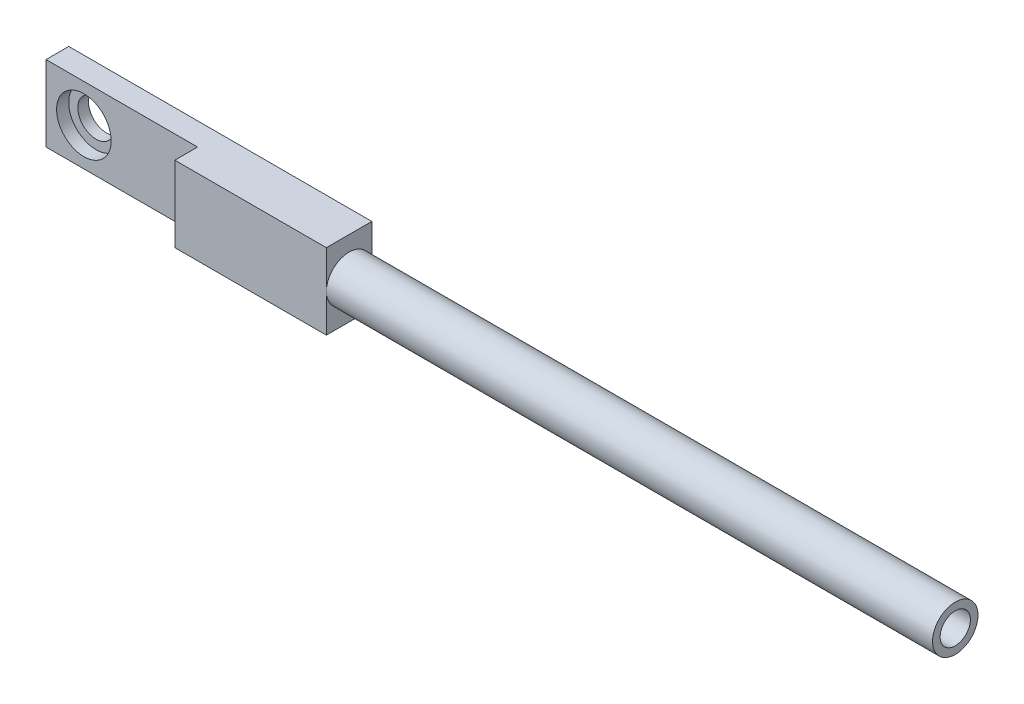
ISO-10303-21;
HEADER;
FILE_DESCRIPTION(('STEP AP214'),'2;1');
FILE_NAME('part.step','',(''),(''),'','','');
FILE_SCHEMA(('AUTOMOTIVE_DESIGN { 1 0 10303 214 1 1 1 1 }'));
ENDSEC;
DATA;
#1=APPLICATION_CONTEXT('core data for automotive mechanical design processes');
#2=APPLICATION_PROTOCOL_DEFINITION('international standard','automotive_design',2000,#1);
#3=PRODUCT_CONTEXT('',#1,'mechanical');
#4=PRODUCT('Part','Part','',(#3));
#5=PRODUCT_RELATED_PRODUCT_CATEGORY('part','',(#4));
#6=PRODUCT_DEFINITION_FORMATION('','',#4);
#7=PRODUCT_DEFINITION_CONTEXT('part definition',#1,'design');
#8=PRODUCT_DEFINITION('design','',#6,#7);
#9=PRODUCT_DEFINITION_SHAPE('','',#8);
#10=(LENGTH_UNIT() NAMED_UNIT(*) SI_UNIT(.MILLI.,.METRE.));
#11=(NAMED_UNIT(*) PLANE_ANGLE_UNIT() SI_UNIT($,.RADIAN.));
#12=(NAMED_UNIT(*) SI_UNIT($,.STERADIAN.) SOLID_ANGLE_UNIT());
#13=UNCERTAINTY_MEASURE_WITH_UNIT(LENGTH_MEASURE(1.E-05),#10,'distance_accuracy_value','');
#14=(GEOMETRIC_REPRESENTATION_CONTEXT(3) GLOBAL_UNCERTAINTY_ASSIGNED_CONTEXT((#13)) GLOBAL_UNIT_ASSIGNED_CONTEXT((#10,
#11,#12)) REPRESENTATION_CONTEXT('',''));
#15=CARTESIAN_POINT('',(0.,0.,0.));
#16=DIRECTION('',(0.,0.,1.));
#17=DIRECTION('',(1.,0.,0.));
#18=AXIS2_PLACEMENT_3D('',#15,#16,#17);
#19=CARTESIAN_POINT('',(12.5,12.5,-2.5));
#20=DIRECTION('',(0.,0.,1.));
#21=DIRECTION('',(1.,0.,0.));
#22=AXIS2_PLACEMENT_3D('',#19,#20,#21);
#23=CYLINDRICAL_SURFACE('',#22,6.);
#24=CARTESIAN_POINT('',(12.5,12.5,0.));
#25=DIRECTION('',(0.,0.,-1.));
#26=DIRECTION('',(-1.,0.,0.));
#27=AXIS2_PLACEMENT_3D('',#24,#25,#26);
#28=CIRCLE('',#27,6.);
#29=CARTESIAN_POINT('',(6.5,12.5,0.));
#30=VERTEX_POINT('',#29);
#31=EDGE_CURVE('E161',#30,#30,#28,.T.);
#32=ORIENTED_EDGE('',*,*,#31,.T.);
#33=EDGE_LOOP('',(#32));
#34=FACE_BOUND('',#33,.T.);
#35=CARTESIAN_POINT('',(12.5,12.5,3.5));
#36=DIRECTION('',(0.,0.,1.));
#37=DIRECTION('',(1.,0.,0.));
#38=AXIS2_PLACEMENT_3D('',#35,#36,#37);
#39=CIRCLE('',#38,6.);
#40=CARTESIAN_POINT('',(18.5,12.5,3.5));
#41=VERTEX_POINT('',#40);
#42=EDGE_CURVE('E41',#41,#41,#39,.F.);
#43=ORIENTED_EDGE('',*,*,#42,.F.);
#44=EDGE_LOOP('',(#43));
#45=FACE_BOUND('',#44,.T.);
#46=ADVANCED_FACE('F37',(#34,#45),#23,.F.);
#47=CARTESIAN_POINT('',(0.,0.,15.));
#48=DIRECTION('',(1.,0.,0.));
#49=DIRECTION('',(0.,0.,-1.));
#50=AXIS2_PLACEMENT_3D('',#47,#48,#49);
#51=PLANE('',#50);
#52=DIRECTION('',(0.,-1.,0.));
#53=VECTOR('',#52,1.);
#54=CARTESIAN_POINT('',(0.,25.,7.5));
#55=LINE('',#54,#53);
#56=CARTESIAN_POINT('',(0.,25.,7.5));
#57=VERTEX_POINT('',#56);
#58=CARTESIAN_POINT('',(0.,0.,7.5));
#59=VERTEX_POINT('',#58);
#60=EDGE_CURVE('E98',#57,#59,#55,.T.);
#61=ORIENTED_EDGE('',*,*,#60,.F.);
#62=DIRECTION('',(0.,0.,-1.));
#63=VECTOR('',#62,1.);
#64=CARTESIAN_POINT('',(0.,25.,15.));
#65=LINE('',#64,#63);
#66=CARTESIAN_POINT('',(0.,25.,0.));
#67=VERTEX_POINT('',#66);
#68=EDGE_CURVE('E126',#57,#67,#65,.T.);
#69=ORIENTED_EDGE('',*,*,#68,.T.);
#70=DIRECTION('',(0.,-1.,0.));
#71=VECTOR('',#70,1.);
#72=CARTESIAN_POINT('',(0.,0.,0.));
#73=LINE('',#72,#71);
#74=CARTESIAN_POINT('',(0.,0.,0.));
#75=VERTEX_POINT('',#74);
#76=EDGE_CURVE('E118',#67,#75,#73,.T.);
#77=ORIENTED_EDGE('',*,*,#76,.T.);
#78=DIRECTION('',(0.,0.,-1.));
#79=VECTOR('',#78,1.);
#80=CARTESIAN_POINT('',(0.,0.,15.));
#81=LINE('',#80,#79);
#82=EDGE_CURVE('E46',#59,#75,#81,.T.);
#83=ORIENTED_EDGE('',*,*,#82,.F.);
#84=EDGE_LOOP('',(#61,#69,#77,#83));
#85=FACE_BOUND('',#84,.T.);
#86=ADVANCED_FACE('F39',(#85),#51,.F.);
#87=CARTESIAN_POINT('',(100.,0.,15.));
#88=DIRECTION('',(-1.,0.,0.));
#89=DIRECTION('',(0.,0.,1.));
#90=AXIS2_PLACEMENT_3D('',#87,#88,#89);
#91=PLANE('',#90);
#92=CARTESIAN_POINT('',(100.,12.5,7.5));
#93=DIRECTION('',(1.,0.,0.));
#94=DIRECTION('',(0.,0.,-1.));
#95=AXIS2_PLACEMENT_3D('',#92,#93,#94);
#96=CIRCLE('',#95,7.5);
#97=CARTESIAN_POINT('',(100.,12.5,0.));
#98=VERTEX_POINT('',#97);
#99=CARTESIAN_POINT('',(100.,12.5,15.));
#100=VERTEX_POINT('',#99);
#101=EDGE_CURVE('E48',#98,#100,#96,.T.);
#102=ORIENTED_EDGE('',*,*,#101,.F.);
#103=DIRECTION('',(0.,1.,0.));
#104=VECTOR('',#103,1.);
#105=CARTESIAN_POINT('',(100.,0.,0.));
#106=LINE('',#105,#104);
#107=CARTESIAN_POINT('',(100.,25.,0.));
#108=VERTEX_POINT('',#107);
#109=EDGE_CURVE('E135',#98,#108,#106,.T.);
#110=ORIENTED_EDGE('',*,*,#109,.T.);
#111=DIRECTION('',(0.,0.,-1.));
#112=VECTOR('',#111,1.);
#113=CARTESIAN_POINT('',(100.,25.,15.));
#114=LINE('',#113,#112);
#115=CARTESIAN_POINT('',(100.,25.,15.));
#116=VERTEX_POINT('',#115);
#117=EDGE_CURVE('E121',#116,#108,#114,.T.);
#118=ORIENTED_EDGE('',*,*,#117,.F.);
#119=DIRECTION('',(0.,1.,0.));
#120=VECTOR('',#119,1.);
#121=CARTESIAN_POINT('',(100.,0.,15.));
#122=LINE('',#121,#120);
#123=EDGE_CURVE('E145',#100,#116,#122,.T.);
#124=ORIENTED_EDGE('',*,*,#123,.F.);
#125=EDGE_LOOP('',(#102,#110,#118,#124));
#126=FACE_BOUND('',#125,.T.);
#127=ADVANCED_FACE('F184',(#126),#91,.F.);
#128=CARTESIAN_POINT('',(0.,0.,15.));
#129=DIRECTION('',(0.,1.,0.));
#130=DIRECTION('',(0.,0.,1.));
#131=AXIS2_PLACEMENT_3D('',#128,#129,#130);
#132=PLANE('',#131);
#133=DIRECTION('',(1.,0.,0.));
#134=VECTOR('',#133,1.);
#135=CARTESIAN_POINT('',(0.,0.,15.));
#136=LINE('',#135,#134);
#137=CARTESIAN_POINT('',(50.,0.,15.));
#138=VERTEX_POINT('',#137);
#139=CARTESIAN_POINT('',(100.,0.,15.));
#140=VERTEX_POINT('',#139);
#141=EDGE_CURVE('E132',#138,#140,#136,.T.);
#142=ORIENTED_EDGE('',*,*,#141,.F.);
#143=DIRECTION('',(0.,0.,1.));
#144=VECTOR('',#143,1.);
#145=CARTESIAN_POINT('',(50.,0.,7.5));
#146=LINE('',#145,#144);
#147=CARTESIAN_POINT('',(50.,0.,7.5));
#148=VERTEX_POINT('',#147);
#149=EDGE_CURVE('E55',#148,#138,#146,.T.);
#150=ORIENTED_EDGE('',*,*,#149,.F.);
#151=DIRECTION('',(1.,0.,0.));
#152=VECTOR('',#151,1.);
#153=CARTESIAN_POINT('',(0.,0.,7.5));
#154=LINE('',#153,#152);
#155=EDGE_CURVE('E102',#59,#148,#154,.T.);
#156=ORIENTED_EDGE('',*,*,#155,.F.);
#157=ORIENTED_EDGE('',*,*,#82,.T.);
#158=DIRECTION('',(1.,0.,0.));
#159=VECTOR('',#158,1.);
#160=CARTESIAN_POINT('',(0.,0.,0.));
#161=LINE('',#160,#159);
#162=CARTESIAN_POINT('',(100.,0.,0.));
#163=VERTEX_POINT('',#162);
#164=EDGE_CURVE('E136',#75,#163,#161,.T.);
#165=ORIENTED_EDGE('',*,*,#164,.T.);
#166=DIRECTION('',(0.,0.,-1.));
#167=VECTOR('',#166,1.);
#168=CARTESIAN_POINT('',(100.,0.,15.));
#169=LINE('',#168,#167);
#170=EDGE_CURVE('E119',#140,#163,#169,.T.);
#171=ORIENTED_EDGE('',*,*,#170,.F.);
#172=EDGE_LOOP('',(#142,#150,#156,#157,#165,#171));
#173=FACE_BOUND('',#172,.T.);
#174=ADVANCED_FACE('F112',(#173),#132,.F.);
#175=EDGE_CURVE('E11',#100,#98,#96,.T.);
#176=ORIENTED_EDGE('',*,*,#175,.F.);
#177=EDGE_CURVE('E142',#140,#100,#122,.T.);
#178=ORIENTED_EDGE('',*,*,#177,.F.);
#179=ORIENTED_EDGE('',*,*,#170,.T.);
#180=EDGE_CURVE('E133',#163,#98,#106,.T.);
#181=ORIENTED_EDGE('',*,*,#180,.T.);
#182=EDGE_LOOP('',(#176,#178,#179,#181));
#183=FACE_BOUND('',#182,.T.);
#184=ADVANCED_FACE('F222',(#183),#91,.F.);
#185=CARTESIAN_POINT('',(0.,25.,15.));
#186=DIRECTION('',(0.,-1.,0.));
#187=DIRECTION('',(0.,0.,-1.));
#188=AXIS2_PLACEMENT_3D('',#185,#186,#187);
#189=PLANE('',#188);
#190=DIRECTION('',(-1.,0.,0.));
#191=VECTOR('',#190,1.);
#192=CARTESIAN_POINT('',(0.,25.,7.5));
#193=LINE('',#192,#191);
#194=CARTESIAN_POINT('',(50.,25.,7.5));
#195=VERTEX_POINT('',#194);
#196=EDGE_CURVE('E104',#195,#57,#193,.T.);
#197=ORIENTED_EDGE('',*,*,#196,.F.);
#198=DIRECTION('',(0.,0.,1.));
#199=VECTOR('',#198,1.);
#200=CARTESIAN_POINT('',(50.,25.,7.5));
#201=LINE('',#200,#199);
#202=CARTESIAN_POINT('',(50.,25.,15.));
#203=VERTEX_POINT('',#202);
#204=EDGE_CURVE('E148',#195,#203,#201,.T.);
#205=ORIENTED_EDGE('',*,*,#204,.T.);
#206=DIRECTION('',(-1.,0.,0.));
#207=VECTOR('',#206,1.);
#208=CARTESIAN_POINT('',(0.,25.,15.));
#209=LINE('',#208,#207);
#210=EDGE_CURVE('E128',#116,#203,#209,.T.);
#211=ORIENTED_EDGE('',*,*,#210,.F.);
#212=ORIENTED_EDGE('',*,*,#117,.T.);
#213=DIRECTION('',(-1.,0.,0.));
#214=VECTOR('',#213,1.);
#215=CARTESIAN_POINT('',(0.,25.,0.));
#216=LINE('',#215,#214);
#217=EDGE_CURVE('E129',#108,#67,#216,.T.);
#218=ORIENTED_EDGE('',*,*,#217,.T.);
#219=ORIENTED_EDGE('',*,*,#68,.F.);
#220=EDGE_LOOP('',(#197,#205,#211,#212,#218,#219));
#221=FACE_BOUND('',#220,.T.);
#222=ADVANCED_FACE('F215',(#221),#189,.F.);
#223=CARTESIAN_POINT('',(0.,0.,15.));
#224=DIRECTION('',(0.,0.,-1.));
#225=DIRECTION('',(-1.,0.,0.));
#226=AXIS2_PLACEMENT_3D('',#223,#224,#225);
#227=PLANE('',#226);
#228=ORIENTED_EDGE('',*,*,#210,.T.);
#229=DIRECTION('',(0.,1.,0.));
#230=VECTOR('',#229,1.);
#231=CARTESIAN_POINT('',(50.,25.,15.));
#232=LINE('',#231,#230);
#233=EDGE_CURVE('E108',#138,#203,#232,.T.);
#234=ORIENTED_EDGE('',*,*,#233,.F.);
#235=ORIENTED_EDGE('',*,*,#141,.T.);
#236=ORIENTED_EDGE('',*,*,#177,.T.);
#237=ORIENTED_EDGE('',*,*,#123,.T.);
#238=EDGE_LOOP('',(#228,#234,#235,#236,#237));
#239=FACE_BOUND('',#238,.T.);
#240=ADVANCED_FACE('F212',(#239),#227,.F.);
#241=CARTESIAN_POINT('',(0.,0.,0.));
#242=DIRECTION('',(0.,0.,-1.));
#243=DIRECTION('',(-1.,0.,0.));
#244=AXIS2_PLACEMENT_3D('',#241,#242,#243);
#245=PLANE('',#244);
#246=ORIENTED_EDGE('',*,*,#31,.F.);
#247=EDGE_LOOP('',(#246));
#248=FACE_BOUND('',#247,.T.);
#249=ORIENTED_EDGE('',*,*,#76,.F.);
#250=ORIENTED_EDGE('',*,*,#217,.F.);
#251=ORIENTED_EDGE('',*,*,#109,.F.);
#252=ORIENTED_EDGE('',*,*,#180,.F.);
#253=ORIENTED_EDGE('',*,*,#164,.F.);
#254=EDGE_LOOP('',(#249,#250,#251,#252,#253));
#255=FACE_BOUND('',#254,.T.);
#256=ADVANCED_FACE('F210',(#248,#255),#245,.T.);
#257=CARTESIAN_POINT('',(300.,12.5,7.5));
#258=DIRECTION('',(-1.,0.,0.));
#259=DIRECTION('',(0.,0.,1.));
#260=AXIS2_PLACEMENT_3D('',#257,#258,#259);
#261=CYLINDRICAL_SURFACE('',#260,7.5);
#262=CARTESIAN_POINT('',(300.,12.5,7.5));
#263=DIRECTION('',(1.,0.,0.));
#264=DIRECTION('',(0.,0.,-1.));
#265=AXIS2_PLACEMENT_3D('',#262,#263,#264);
#266=CIRCLE('',#265,7.5);
#267=CARTESIAN_POINT('',(300.,12.5,0.));
#268=VERTEX_POINT('',#267);
#269=EDGE_CURVE('E139',#268,#268,#266,.T.);
#270=ORIENTED_EDGE('',*,*,#269,.F.);
#271=EDGE_LOOP('',(#270));
#272=FACE_BOUND('',#271,.T.);
#273=ORIENTED_EDGE('',*,*,#101,.T.);
#274=ORIENTED_EDGE('',*,*,#175,.T.);
#275=EDGE_LOOP('',(#273,#274));
#276=FACE_BOUND('',#275,.T.);
#277=ADVANCED_FACE('F206',(#272,#276),#261,.T.);
#278=CARTESIAN_POINT('',(300.,12.5,7.5));
#279=DIRECTION('',(1.,0.,0.));
#280=DIRECTION('',(0.,0.,-1.));
#281=AXIS2_PLACEMENT_3D('',#278,#279,#280);
#282=PLANE('',#281);
#283=CARTESIAN_POINT('',(300.,12.5,7.5));
#284=DIRECTION('',(1.,0.,0.));
#285=DIRECTION('',(0.,0.,-1.));
#286=AXIS2_PLACEMENT_3D('',#283,#284,#285);
#287=CIRCLE('',#286,5.);
#288=CARTESIAN_POINT('',(300.,12.5,2.5));
#289=VERTEX_POINT('',#288);
#290=EDGE_CURVE('E158',#289,#289,#287,.T.);
#291=ORIENTED_EDGE('',*,*,#290,.F.);
#292=EDGE_LOOP('',(#291));
#293=FACE_BOUND('',#292,.T.);
#294=ORIENTED_EDGE('',*,*,#269,.T.);
#295=EDGE_LOOP('',(#294));
#296=FACE_BOUND('',#295,.T.);
#297=ADVANCED_FACE('F203',(#293,#296),#282,.T.);
#298=CARTESIAN_POINT('',(50.,25.,7.5));
#299=DIRECTION('',(1.,0.,0.));
#300=DIRECTION('',(0.,0.,-1.));
#301=AXIS2_PLACEMENT_3D('',#298,#299,#300);
#302=PLANE('',#301);
#303=ORIENTED_EDGE('',*,*,#233,.T.);
#304=ORIENTED_EDGE('',*,*,#204,.F.);
#305=DIRECTION('',(0.,1.,0.));
#306=VECTOR('',#305,1.);
#307=CARTESIAN_POINT('',(50.,25.,7.5));
#308=LINE('',#307,#306);
#309=EDGE_CURVE('E114',#148,#195,#308,.T.);
#310=ORIENTED_EDGE('',*,*,#309,.F.);
#311=ORIENTED_EDGE('',*,*,#149,.T.);
#312=EDGE_LOOP('',(#303,#304,#310,#311));
#313=FACE_BOUND('',#312,.T.);
#314=ADVANCED_FACE('F199',(#313),#302,.F.);
#315=CARTESIAN_POINT('',(0.,0.,7.5));
#316=DIRECTION('',(0.,0.,1.));
#317=DIRECTION('',(1.,0.,0.));
#318=AXIS2_PLACEMENT_3D('',#315,#316,#317);
#319=PLANE('',#318);
#320=CARTESIAN_POINT('',(12.5,12.5,7.5));
#321=DIRECTION('',(0.,0.,1.));
#322=DIRECTION('',(1.,0.,0.));
#323=AXIS2_PLACEMENT_3D('',#320,#321,#322);
#324=CIRCLE('',#323,9.);
#325=CARTESIAN_POINT('',(21.5,12.5,7.5));
#326=VERTEX_POINT('',#325);
#327=EDGE_CURVE('E166',#326,#326,#324,.T.);
#328=ORIENTED_EDGE('',*,*,#327,.F.);
#329=EDGE_LOOP('',(#328));
#330=FACE_BOUND('',#329,.T.);
#331=ORIENTED_EDGE('',*,*,#60,.T.);
#332=ORIENTED_EDGE('',*,*,#155,.T.);
#333=ORIENTED_EDGE('',*,*,#309,.T.);
#334=ORIENTED_EDGE('',*,*,#196,.T.);
#335=EDGE_LOOP('',(#331,#332,#333,#334));
#336=FACE_BOUND('',#335,.T.);
#337=ADVANCED_FACE('F100',(#330,#336),#319,.T.);
#338=CARTESIAN_POINT('',(100.,12.5,7.5));
#339=DIRECTION('',(1.,0.,0.));
#340=DIRECTION('',(0.,0.,-1.));
#341=AXIS2_PLACEMENT_3D('',#338,#339,#340);
#342=CYLINDRICAL_SURFACE('',#341,5.);
#343=CARTESIAN_POINT('',(100.,12.5,7.5));
#344=DIRECTION('',(1.,0.,0.));
#345=DIRECTION('',(0.,0.,-1.));
#346=AXIS2_PLACEMENT_3D('',#343,#344,#345);
#347=CIRCLE('',#346,5.);
#348=CARTESIAN_POINT('',(100.,12.5,2.5));
#349=VERTEX_POINT('',#348);
#350=EDGE_CURVE('E155',#349,#349,#347,.T.);
#351=ORIENTED_EDGE('',*,*,#350,.F.);
#352=EDGE_LOOP('',(#351));
#353=FACE_BOUND('',#352,.T.);
#354=ORIENTED_EDGE('',*,*,#290,.T.);
#355=EDGE_LOOP('',(#354));
#356=FACE_BOUND('',#355,.T.);
#357=ADVANCED_FACE('F192',(#353,#356),#342,.F.);
#358=CARTESIAN_POINT('',(100.,12.5,7.5));
#359=DIRECTION('',(1.,0.,0.));
#360=DIRECTION('',(0.,0.,-1.));
#361=AXIS2_PLACEMENT_3D('',#358,#359,#360);
#362=PLANE('',#361);
#363=ORIENTED_EDGE('',*,*,#350,.T.);
#364=EDGE_LOOP('',(#363));
#365=FACE_BOUND('',#364,.T.);
#366=ADVANCED_FACE('F189',(#365),#362,.T.);
#367=CARTESIAN_POINT('',(12.5,12.5,3.5));
#368=DIRECTION('',(0.,0.,1.));
#369=DIRECTION('',(1.,0.,0.));
#370=AXIS2_PLACEMENT_3D('',#367,#368,#369);
#371=PLANE('',#370);
#372=CARTESIAN_POINT('',(12.5,12.5,3.5));
#373=DIRECTION('',(0.,0.,1.));
#374=DIRECTION('',(1.,0.,0.));
#375=AXIS2_PLACEMENT_3D('',#372,#373,#374);
#376=CIRCLE('',#375,9.);
#377=CARTESIAN_POINT('',(21.5,12.5,3.5));
#378=VERTEX_POINT('',#377);
#379=EDGE_CURVE('E169',#378,#378,#376,.T.);
#380=ORIENTED_EDGE('',*,*,#379,.T.);
#381=EDGE_LOOP('',(#380));
#382=FACE_BOUND('',#381,.T.);
#383=ORIENTED_EDGE('',*,*,#42,.T.);
#384=EDGE_LOOP('',(#383));
#385=FACE_BOUND('',#384,.T.);
#386=ADVANCED_FACE('F176',(#382,#385),#371,.T.);
#387=CARTESIAN_POINT('',(12.5,12.5,3.5));
#388=DIRECTION('',(0.,0.,1.));
#389=DIRECTION('',(1.,0.,0.));
#390=AXIS2_PLACEMENT_3D('',#387,#388,#389);
#391=CYLINDRICAL_SURFACE('',#390,9.);
#392=ORIENTED_EDGE('',*,*,#379,.F.);
#393=EDGE_LOOP('',(#392));
#394=FACE_BOUND('',#393,.T.);
#395=ORIENTED_EDGE('',*,*,#327,.T.);
#396=EDGE_LOOP('',(#395));
#397=FACE_BOUND('',#396,.T.);
#398=ADVANCED_FACE('F187',(#394,#397),#391,.F.);
#399=CLOSED_SHELL('',(#46,#86,#127,#174,#184,#222,#240,#256,#277,#297,#314,#337,#357,#366,#386,#398));
#400=MANIFOLD_SOLID_BREP('B2',#399);
#401=ADVANCED_BREP_SHAPE_REPRESENTATION('',(#18,#400),#14);
#402=SHAPE_DEFINITION_REPRESENTATION(#9,#401);
ENDSEC;
END-ISO-10303-21;
